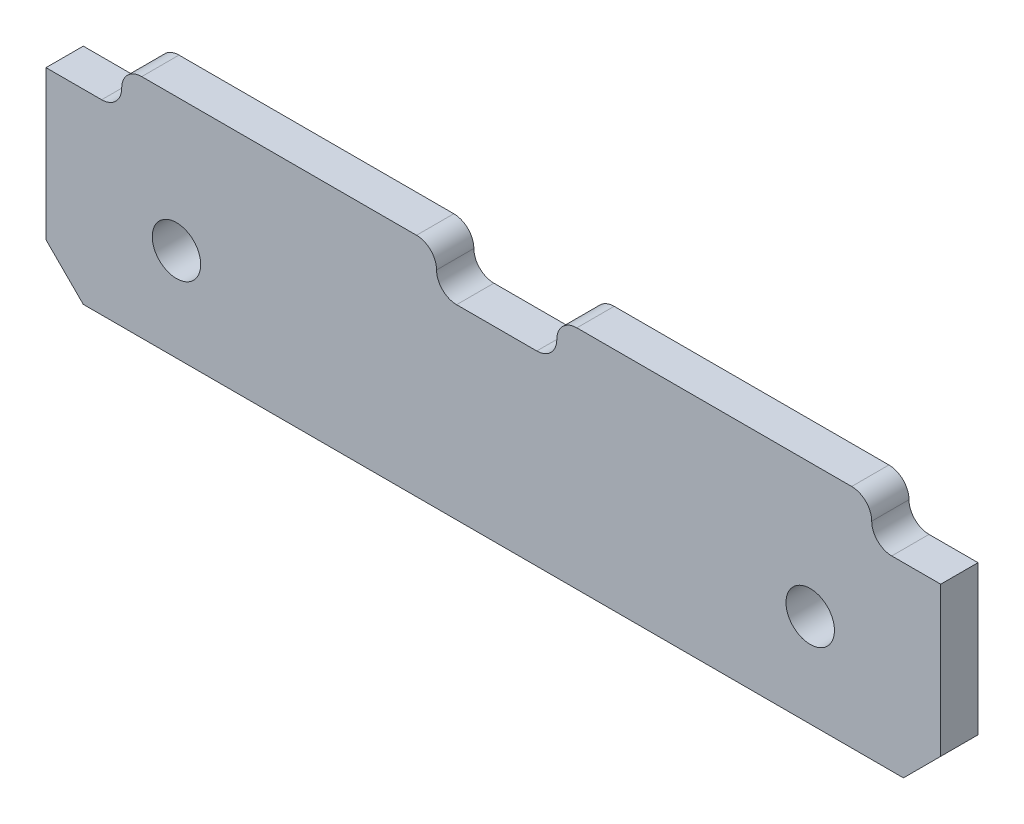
ISO-10303-21;
HEADER;
FILE_DESCRIPTION(('STEP AP214'),'2;1');
FILE_NAME('part.step','',(''),(''),'','','');
FILE_SCHEMA(('AUTOMOTIVE_DESIGN { 1 0 10303 214 1 1 1 1 }'));
ENDSEC;
DATA;
#1=APPLICATION_CONTEXT('core data for automotive mechanical design processes');
#2=APPLICATION_PROTOCOL_DEFINITION('international standard','automotive_design',2000,#1);
#3=PRODUCT_CONTEXT('',#1,'mechanical');
#4=PRODUCT('Part','Part','',(#3));
#5=PRODUCT_RELATED_PRODUCT_CATEGORY('part','',(#4));
#6=PRODUCT_DEFINITION_FORMATION('','',#4);
#7=PRODUCT_DEFINITION_CONTEXT('part definition',#1,'design');
#8=PRODUCT_DEFINITION('design','',#6,#7);
#9=PRODUCT_DEFINITION_SHAPE('','',#8);
#10=(LENGTH_UNIT() NAMED_UNIT(*) SI_UNIT(.MILLI.,.METRE.));
#11=(NAMED_UNIT(*) PLANE_ANGLE_UNIT() SI_UNIT($,.RADIAN.));
#12=(NAMED_UNIT(*) SI_UNIT($,.STERADIAN.) SOLID_ANGLE_UNIT());
#13=UNCERTAINTY_MEASURE_WITH_UNIT(LENGTH_MEASURE(1.E-05),#10,'distance_accuracy_value','');
#14=(GEOMETRIC_REPRESENTATION_CONTEXT(3) GLOBAL_UNCERTAINTY_ASSIGNED_CONTEXT((#13)) GLOBAL_UNIT_ASSIGNED_CONTEXT((#10,
#11,#12)) REPRESENTATION_CONTEXT('',''));
#15=CARTESIAN_POINT('',(0.,0.,0.));
#16=DIRECTION('',(0.,0.,1.));
#17=DIRECTION('',(1.,0.,0.));
#18=AXIS2_PLACEMENT_3D('',#15,#16,#17);
#19=CARTESIAN_POINT('',(0.,0.,10.));
#20=DIRECTION('',(0.,-1.,0.));
#21=DIRECTION('',(0.,0.,-1.));
#22=AXIS2_PLACEMENT_3D('',#19,#20,#21);
#23=PLANE('',#22);
#24=DIRECTION('',(0.,0.,-1.));
#25=VECTOR('',#24,1.);
#26=CARTESIAN_POINT('',(14.9254349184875,0.,10.));
#27=LINE('',#26,#25);
#28=CARTESIAN_POINT('',(14.9254349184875,0.,10.));
#29=VERTEX_POINT('',#28);
#30=CARTESIAN_POINT('',(14.9254349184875,0.,0.));
#31=VERTEX_POINT('',#30);
#32=EDGE_CURVE('E172',#29,#31,#27,.T.);
#33=ORIENTED_EDGE('',*,*,#32,.T.);
#34=DIRECTION('',(-1.,0.,0.));
#35=VECTOR('',#34,1.);
#36=CARTESIAN_POINT('',(0.,0.,0.));
#37=LINE('',#36,#35);
#38=CARTESIAN_POINT('',(0.,0.,0.));
#39=VERTEX_POINT('',#38);
#40=EDGE_CURVE('E281',#31,#39,#37,.T.);
#41=ORIENTED_EDGE('',*,*,#40,.T.);
#42=DIRECTION('',(0.,0.,-1.));
#43=VECTOR('',#42,1.);
#44=CARTESIAN_POINT('',(0.,0.,10.));
#45=LINE('',#44,#43);
#46=CARTESIAN_POINT('',(0.,0.,10.));
#47=VERTEX_POINT('',#46);
#48=EDGE_CURVE('E273',#47,#39,#45,.T.);
#49=ORIENTED_EDGE('',*,*,#48,.F.);
#50=DIRECTION('',(-1.,0.,0.));
#51=VECTOR('',#50,1.);
#52=CARTESIAN_POINT('',(0.,0.,10.));
#53=LINE('',#52,#51);
#54=EDGE_CURVE('E269',#29,#47,#53,.T.);
#55=ORIENTED_EDGE('',*,*,#54,.F.);
#56=EDGE_LOOP('',(#33,#41,#49,#55));
#57=FACE_BOUND('',#56,.T.);
#58=ADVANCED_FACE('F33',(#57),#23,.F.);
#59=CARTESIAN_POINT('',(131.646889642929,0.,0.));
#60=VERTEX_POINT('',#59);
#61=CARTESIAN_POINT('',(110.141513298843,0.,0.));
#62=VERTEX_POINT('',#61);
#63=EDGE_CURVE('E283',#60,#62,#37,.T.);
#64=ORIENTED_EDGE('',*,*,#63,.T.);
#65=DIRECTION('',(0.,0.,-1.));
#66=VECTOR('',#65,1.);
#67=CARTESIAN_POINT('',(110.141513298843,0.,10.));
#68=LINE('',#67,#66);
#69=CARTESIAN_POINT('',(110.141513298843,0.,10.));
#70=VERTEX_POINT('',#69);
#71=EDGE_CURVE('E196',#70,#62,#68,.T.);
#72=ORIENTED_EDGE('',*,*,#71,.F.);
#73=CARTESIAN_POINT('',(131.646889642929,0.,10.));
#74=VERTEX_POINT('',#73);
#75=EDGE_CURVE('E274',#74,#70,#53,.T.);
#76=ORIENTED_EDGE('',*,*,#75,.F.);
#77=DIRECTION('',(0.,0.,-1.));
#78=VECTOR('',#77,1.);
#79=CARTESIAN_POINT('',(131.646889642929,0.,10.));
#80=LINE('',#79,#78);
#81=EDGE_CURVE('E251',#74,#60,#80,.T.);
#82=ORIENTED_EDGE('',*,*,#81,.T.);
#83=EDGE_LOOP('',(#64,#72,#76,#82));
#84=FACE_BOUND('',#83,.T.);
#85=ADVANCED_FACE('F315',(#84),#23,.F.);
#86=CARTESIAN_POINT('',(0.,0.,10.));
#87=DIRECTION('',(1.,0.,0.));
#88=DIRECTION('',(0.,1.,0.));
#89=AXIS2_PLACEMENT_3D('',#86,#87,#88);
#90=PLANE('',#89);
#91=DIRECTION('',(0.,-1.,0.));
#92=VECTOR('',#91,1.);
#93=CARTESIAN_POINT('',(0.,0.,0.));
#94=LINE('',#93,#92);
#95=CARTESIAN_POINT('',(0.,-39.9999999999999,0.));
#96=VERTEX_POINT('',#95);
#97=EDGE_CURVE('E250',#39,#96,#94,.T.);
#98=ORIENTED_EDGE('',*,*,#97,.T.);
#99=DIRECTION('',(0.,0.,1.));
#100=VECTOR('',#99,1.);
#101=CARTESIAN_POINT('',(0.,-39.9999999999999,10.));
#102=LINE('',#101,#100);
#103=CARTESIAN_POINT('',(0.,-39.9999999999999,10.));
#104=VERTEX_POINT('',#103);
#105=EDGE_CURVE('E56',#96,#104,#102,.T.);
#106=ORIENTED_EDGE('',*,*,#105,.T.);
#107=DIRECTION('',(0.,-1.,0.));
#108=VECTOR('',#107,1.);
#109=CARTESIAN_POINT('',(0.,0.,10.));
#110=LINE('',#109,#108);
#111=EDGE_CURVE('E262',#47,#104,#110,.T.);
#112=ORIENTED_EDGE('',*,*,#111,.F.);
#113=ORIENTED_EDGE('',*,*,#48,.T.);
#114=EDGE_LOOP('',(#98,#106,#112,#113));
#115=FACE_BOUND('',#114,.T.);
#116=ADVANCED_FACE('F311',(#115),#90,.F.);
#117=CARTESIAN_POINT('',(0.,-50.,10.));
#118=DIRECTION('',(0.,1.,0.));
#119=DIRECTION('',(0.,0.,1.));
#120=AXIS2_PLACEMENT_3D('',#117,#118,#119);
#121=PLANE('',#120);
#122=DIRECTION('',(1.,0.,0.));
#123=VECTOR('',#122,1.);
#124=CARTESIAN_POINT('',(0.,-50.,10.));
#125=LINE('',#124,#123);
#126=CARTESIAN_POINT('',(10.,-50.,10.));
#127=VERTEX_POINT('',#126);
#128=CARTESIAN_POINT('',(230.,-50.,10.));
#129=VERTEX_POINT('',#128);
#130=EDGE_CURVE('E264',#127,#129,#125,.T.);
#131=ORIENTED_EDGE('',*,*,#130,.F.);
#132=DIRECTION('',(0.,0.,-1.));
#133=VECTOR('',#132,1.);
#134=CARTESIAN_POINT('',(10.,-50.,10.));
#135=LINE('',#134,#133);
#136=CARTESIAN_POINT('',(10.,-50.,0.));
#137=VERTEX_POINT('',#136);
#138=EDGE_CURVE('E291',#127,#137,#135,.T.);
#139=ORIENTED_EDGE('',*,*,#138,.T.);
#140=DIRECTION('',(1.,0.,0.));
#141=VECTOR('',#140,1.);
#142=CARTESIAN_POINT('',(0.,-50.,0.));
#143=LINE('',#142,#141);
#144=CARTESIAN_POINT('',(230.,-50.,0.));
#145=VERTEX_POINT('',#144);
#146=EDGE_CURVE('E276',#137,#145,#143,.T.);
#147=ORIENTED_EDGE('',*,*,#146,.T.);
#148=DIRECTION('',(0.,0.,1.));
#149=VECTOR('',#148,1.);
#150=CARTESIAN_POINT('',(230.,-50.,10.));
#151=LINE('',#150,#149);
#152=EDGE_CURVE('E289',#145,#129,#151,.T.);
#153=ORIENTED_EDGE('',*,*,#152,.T.);
#154=EDGE_LOOP('',(#131,#139,#147,#153));
#155=FACE_BOUND('',#154,.T.);
#156=ADVANCED_FACE('F304',(#155),#121,.F.);
#157=CARTESIAN_POINT('',(240.,0.,10.));
#158=DIRECTION('',(-1.,0.,0.));
#159=DIRECTION('',(0.,0.,1.));
#160=AXIS2_PLACEMENT_3D('',#157,#158,#159);
#161=PLANE('',#160);
#162=DIRECTION('',(0.,1.,0.));
#163=VECTOR('',#162,1.);
#164=CARTESIAN_POINT('',(240.,0.,10.));
#165=LINE('',#164,#163);
#166=CARTESIAN_POINT('',(240.,-40.,10.));
#167=VERTEX_POINT('',#166);
#168=CARTESIAN_POINT('',(240.,0.,10.));
#169=VERTEX_POINT('',#168);
#170=EDGE_CURVE('E267',#167,#169,#165,.T.);
#171=ORIENTED_EDGE('',*,*,#170,.F.);
#172=DIRECTION('',(0.,0.,-1.));
#173=VECTOR('',#172,1.);
#174=CARTESIAN_POINT('',(240.,-40.,10.));
#175=LINE('',#174,#173);
#176=CARTESIAN_POINT('',(240.,-40.,0.));
#177=VERTEX_POINT('',#176);
#178=EDGE_CURVE('E11',#167,#177,#175,.T.);
#179=ORIENTED_EDGE('',*,*,#178,.T.);
#180=DIRECTION('',(0.,1.,0.));
#181=VECTOR('',#180,1.);
#182=CARTESIAN_POINT('',(240.,0.,0.));
#183=LINE('',#182,#181);
#184=CARTESIAN_POINT('',(240.,0.,0.));
#185=VERTEX_POINT('',#184);
#186=EDGE_CURVE('E279',#177,#185,#183,.T.);
#187=ORIENTED_EDGE('',*,*,#186,.T.);
#188=DIRECTION('',(0.,0.,-1.));
#189=VECTOR('',#188,1.);
#190=CARTESIAN_POINT('',(240.,0.,10.));
#191=LINE('',#190,#189);
#192=EDGE_CURVE('E286',#169,#185,#191,.T.);
#193=ORIENTED_EDGE('',*,*,#192,.F.);
#194=EDGE_LOOP('',(#171,#179,#187,#193));
#195=FACE_BOUND('',#194,.T.);
#196=ADVANCED_FACE('F354',(#195),#161,.F.);
#197=CARTESIAN_POINT('',(226.862968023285,0.,0.));
#198=VERTEX_POINT('',#197);
#199=EDGE_CURVE('E265',#185,#198,#37,.T.);
#200=ORIENTED_EDGE('',*,*,#199,.T.);
#201=DIRECTION('',(0.,0.,-1.));
#202=VECTOR('',#201,1.);
#203=CARTESIAN_POINT('',(226.862968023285,0.,10.));
#204=LINE('',#203,#202);
#205=CARTESIAN_POINT('',(226.862968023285,0.,10.));
#206=VERTEX_POINT('',#205);
#207=EDGE_CURVE('E254',#206,#198,#204,.T.);
#208=ORIENTED_EDGE('',*,*,#207,.F.);
#209=EDGE_CURVE('E270',#169,#206,#53,.T.);
#210=ORIENTED_EDGE('',*,*,#209,.F.);
#211=ORIENTED_EDGE('',*,*,#192,.T.);
#212=EDGE_LOOP('',(#200,#208,#210,#211));
#213=FACE_BOUND('',#212,.T.);
#214=ADVANCED_FACE('F350',(#213),#23,.F.);
#215=CARTESIAN_POINT('',(0.,0.,10.));
#216=DIRECTION('',(0.,0.,1.));
#217=DIRECTION('',(1.,0.,0.));
#218=AXIS2_PLACEMENT_3D('',#215,#216,#217);
#219=PLANE('',#218);
#220=CARTESIAN_POINT('',(35.,-25.,10.));
#221=DIRECTION('',(0.,0.,-1.));
#222=DIRECTION('',(-1.,0.,0.));
#223=AXIS2_PLACEMENT_3D('',#220,#221,#222);
#224=CIRCLE('',#223,6.5);
#225=CARTESIAN_POINT('',(28.5,-25.,10.));
#226=VERTEX_POINT('',#225);
#227=EDGE_CURVE('E549',#226,#226,#224,.T.);
#228=ORIENTED_EDGE('',*,*,#227,.T.);
#229=EDGE_LOOP('',(#228));
#230=FACE_BOUND('',#229,.T.);
#231=CARTESIAN_POINT('',(205.,-25.,10.));
#232=DIRECTION('',(0.,0.,-1.));
#233=DIRECTION('',(-1.,0.,0.));
#234=AXIS2_PLACEMENT_3D('',#231,#232,#233);
#235=CIRCLE('',#234,6.50000000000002);
#236=CARTESIAN_POINT('',(198.5,-25.,10.));
#237=VERTEX_POINT('',#236);
#238=EDGE_CURVE('E201',#237,#237,#235,.T.);
#239=ORIENTED_EDGE('',*,*,#238,.T.);
#240=EDGE_LOOP('',(#239));
#241=FACE_BOUND('',#240,.T.);
#242=ORIENTED_EDGE('',*,*,#111,.T.);
#243=DIRECTION('',(-0.707106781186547,0.707106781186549,0.));
#244=VECTOR('',#243,1.);
#245=CARTESIAN_POINT('',(-20.,-19.9999999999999,10.));
#246=LINE('',#245,#244);
#247=EDGE_CURVE('E41',#104,#127,#246,.F.);
#248=ORIENTED_EDGE('',*,*,#247,.T.);
#249=ORIENTED_EDGE('',*,*,#130,.T.);
#250=DIRECTION('',(-0.707106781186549,-0.707106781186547,0.));
#251=VECTOR('',#250,1.);
#252=CARTESIAN_POINT('',(140.,-140.,10.));
#253=LINE('',#252,#251);
#254=EDGE_CURVE('E48',#129,#167,#253,.F.);
#255=ORIENTED_EDGE('',*,*,#254,.T.);
#256=ORIENTED_EDGE('',*,*,#170,.T.);
#257=ORIENTED_EDGE('',*,*,#209,.T.);
#258=CARTESIAN_POINT('',(226.862968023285,5.37634408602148,10.));
#259=DIRECTION('',(0.,0.,1.));
#260=DIRECTION('',(-1.,0.,0.));
#261=AXIS2_PLACEMENT_3D('',#258,#259,#260);
#262=CIRCLE('',#261,5.37634408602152);
#263=CARTESIAN_POINT('',(221.486623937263,5.37634408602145,10.));
#264=VERTEX_POINT('',#263);
#265=EDGE_CURVE('E228',#264,#206,#262,.T.);
#266=ORIENTED_EDGE('',*,*,#265,.F.);
#267=CARTESIAN_POINT('',(216.110279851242,5.37634408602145,10.));
#268=DIRECTION('',(0.,0.,-1.));
#269=DIRECTION('',(-1.,0.,0.));
#270=AXIS2_PLACEMENT_3D('',#267,#268,#269);
#271=CIRCLE('',#270,5.37634408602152);
#272=CARTESIAN_POINT('',(216.110279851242,10.752688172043,10.));
#273=VERTEX_POINT('',#272);
#274=EDGE_CURVE('E225',#273,#264,#271,.T.);
#275=ORIENTED_EDGE('',*,*,#274,.F.);
#276=DIRECTION('',(1.,0.,0.));
#277=VECTOR('',#276,1.);
#278=CARTESIAN_POINT('',(216.110279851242,10.752688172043,10.));
#279=LINE('',#278,#277);
#280=CARTESIAN_POINT('',(142.399577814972,10.752688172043,10.));
#281=VERTEX_POINT('',#280);
#282=EDGE_CURVE('E221',#281,#273,#279,.T.);
#283=ORIENTED_EDGE('',*,*,#282,.F.);
#284=CARTESIAN_POINT('',(142.399577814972,5.37634408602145,10.));
#285=DIRECTION('',(0.,0.,-1.));
#286=DIRECTION('',(-1.,0.,0.));
#287=AXIS2_PLACEMENT_3D('',#284,#285,#286);
#288=CIRCLE('',#287,5.3763440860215);
#289=CARTESIAN_POINT('',(137.023233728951,5.37634408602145,10.));
#290=VERTEX_POINT('',#289);
#291=EDGE_CURVE('E218',#290,#281,#288,.T.);
#292=ORIENTED_EDGE('',*,*,#291,.F.);
#293=CARTESIAN_POINT('',(131.646889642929,5.37634408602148,10.));
#294=DIRECTION('',(0.,0.,1.));
#295=DIRECTION('',(-1.,0.,0.));
#296=AXIS2_PLACEMENT_3D('',#293,#294,#295);
#297=CIRCLE('',#296,5.3763440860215);
#298=EDGE_CURVE('E231',#74,#290,#297,.T.);
#299=ORIENTED_EDGE('',*,*,#298,.F.);
#300=ORIENTED_EDGE('',*,*,#75,.T.);
#301=CARTESIAN_POINT('',(110.141513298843,5.37634408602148,10.));
#302=DIRECTION('',(0.,0.,1.));
#303=DIRECTION('',(-1.,0.,0.));
#304=AXIS2_PLACEMENT_3D('',#301,#302,#303);
#305=CIRCLE('',#304,5.3763440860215);
#306=CARTESIAN_POINT('',(104.765169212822,5.37634408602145,10.));
#307=VERTEX_POINT('',#306);
#308=EDGE_CURVE('E185',#307,#70,#305,.T.);
#309=ORIENTED_EDGE('',*,*,#308,.F.);
#310=CARTESIAN_POINT('',(99.3888251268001,5.37634408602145,10.));
#311=DIRECTION('',(0.,0.,-1.));
#312=DIRECTION('',(-1.,0.,0.));
#313=AXIS2_PLACEMENT_3D('',#310,#311,#312);
#314=CIRCLE('',#313,5.37634408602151);
#315=CARTESIAN_POINT('',(99.3888251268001,10.752688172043,10.));
#316=VERTEX_POINT('',#315);
#317=EDGE_CURVE('E193',#316,#307,#314,.T.);
#318=ORIENTED_EDGE('',*,*,#317,.F.);
#319=DIRECTION('',(1.,0.,0.));
#320=VECTOR('',#319,1.);
#321=CARTESIAN_POINT('',(99.3888251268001,10.752688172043,10.));
#322=LINE('',#321,#320);
#323=CARTESIAN_POINT('',(25.6781230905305,10.752688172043,10.));
#324=VERTEX_POINT('',#323);
#325=EDGE_CURVE('E180',#324,#316,#322,.T.);
#326=ORIENTED_EDGE('',*,*,#325,.F.);
#327=CARTESIAN_POINT('',(25.6781230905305,5.37634408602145,10.));
#328=DIRECTION('',(0.,0.,-1.));
#329=DIRECTION('',(-1.,0.,0.));
#330=AXIS2_PLACEMENT_3D('',#327,#328,#329);
#331=CIRCLE('',#330,5.37634408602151);
#332=CARTESIAN_POINT('',(20.301779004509,5.37634408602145,10.));
#333=VERTEX_POINT('',#332);
#334=EDGE_CURVE('E164',#333,#324,#331,.T.);
#335=ORIENTED_EDGE('',*,*,#334,.F.);
#336=CARTESIAN_POINT('',(14.9254349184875,5.37634408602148,10.));
#337=DIRECTION('',(0.,0.,1.));
#338=DIRECTION('',(-1.,0.,0.));
#339=AXIS2_PLACEMENT_3D('',#336,#337,#338);
#340=CIRCLE('',#339,5.37634408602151);
#341=EDGE_CURVE('E177',#29,#333,#340,.T.);
#342=ORIENTED_EDGE('',*,*,#341,.F.);
#343=ORIENTED_EDGE('',*,*,#54,.T.);
#344=EDGE_LOOP('',(#242,#248,#249,#255,#256,#257,#266,#275,#283,#292,#299,#300,#309,#318,#326,
#335,#342,#343));
#345=FACE_BOUND('',#344,.T.);
#346=ADVANCED_FACE('F176',(#230,#241,#345),#219,.T.);
#347=CARTESIAN_POINT('',(0.,0.,0.));
#348=DIRECTION('',(0.,0.,1.));
#349=DIRECTION('',(1.,0.,0.));
#350=AXIS2_PLACEMENT_3D('',#347,#348,#349);
#351=PLANE('',#350);
#352=CARTESIAN_POINT('',(35.,-25.,0.));
#353=DIRECTION('',(0.,0.,-1.));
#354=DIRECTION('',(-1.,0.,0.));
#355=AXIS2_PLACEMENT_3D('',#352,#353,#354);
#356=CIRCLE('',#355,6.5);
#357=CARTESIAN_POINT('',(28.5,-25.,0.));
#358=VERTEX_POINT('',#357);
#359=EDGE_CURVE('E552',#358,#358,#356,.T.);
#360=ORIENTED_EDGE('',*,*,#359,.F.);
#361=EDGE_LOOP('',(#360));
#362=FACE_BOUND('',#361,.T.);
#363=CARTESIAN_POINT('',(205.,-25.,0.));
#364=DIRECTION('',(0.,0.,-1.));
#365=DIRECTION('',(-1.,0.,0.));
#366=AXIS2_PLACEMENT_3D('',#363,#364,#365);
#367=CIRCLE('',#366,6.50000000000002);
#368=CARTESIAN_POINT('',(198.5,-25.,0.));
#369=VERTEX_POINT('',#368);
#370=EDGE_CURVE('E554',#369,#369,#367,.T.);
#371=ORIENTED_EDGE('',*,*,#370,.F.);
#372=EDGE_LOOP('',(#371));
#373=FACE_BOUND('',#372,.T.);
#374=ORIENTED_EDGE('',*,*,#146,.F.);
#375=DIRECTION('',(0.707106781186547,-0.707106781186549,0.));
#376=VECTOR('',#375,1.);
#377=CARTESIAN_POINT('',(10.,-50.,0.));
#378=LINE('',#377,#376);
#379=EDGE_CURVE('E296',#137,#96,#378,.F.);
#380=ORIENTED_EDGE('',*,*,#379,.T.);
#381=ORIENTED_EDGE('',*,*,#97,.F.);
#382=ORIENTED_EDGE('',*,*,#40,.F.);
#383=CARTESIAN_POINT('',(14.9254349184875,5.37634408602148,0.));
#384=DIRECTION('',(0.,0.,1.));
#385=DIRECTION('',(-1.,0.,0.));
#386=AXIS2_PLACEMENT_3D('',#383,#384,#385);
#387=CIRCLE('',#386,5.37634408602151);
#388=CARTESIAN_POINT('',(20.301779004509,5.37634408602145,0.));
#389=VERTEX_POINT('',#388);
#390=EDGE_CURVE('E200',#31,#389,#387,.T.);
#391=ORIENTED_EDGE('',*,*,#390,.T.);
#392=CARTESIAN_POINT('',(25.6781230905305,5.37634408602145,0.));
#393=DIRECTION('',(0.,0.,-1.));
#394=DIRECTION('',(-1.,0.,0.));
#395=AXIS2_PLACEMENT_3D('',#392,#393,#394);
#396=CIRCLE('',#395,5.37634408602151);
#397=CARTESIAN_POINT('',(25.6781230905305,10.752688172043,0.));
#398=VERTEX_POINT('',#397);
#399=EDGE_CURVE('E166',#389,#398,#396,.T.);
#400=ORIENTED_EDGE('',*,*,#399,.T.);
#401=DIRECTION('',(1.,0.,0.));
#402=VECTOR('',#401,1.);
#403=CARTESIAN_POINT('',(99.3888251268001,10.752688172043,0.));
#404=LINE('',#403,#402);
#405=CARTESIAN_POINT('',(99.3888251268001,10.752688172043,0.));
#406=VERTEX_POINT('',#405);
#407=EDGE_CURVE('E204',#398,#406,#404,.T.);
#408=ORIENTED_EDGE('',*,*,#407,.T.);
#409=CARTESIAN_POINT('',(99.3888251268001,5.37634408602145,0.));
#410=DIRECTION('',(0.,0.,-1.));
#411=DIRECTION('',(-1.,0.,0.));
#412=AXIS2_PLACEMENT_3D('',#409,#410,#411);
#413=CIRCLE('',#412,5.37634408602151);
#414=CARTESIAN_POINT('',(104.765169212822,5.37634408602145,0.));
#415=VERTEX_POINT('',#414);
#416=EDGE_CURVE('E188',#406,#415,#413,.T.);
#417=ORIENTED_EDGE('',*,*,#416,.T.);
#418=CARTESIAN_POINT('',(110.141513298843,5.37634408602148,0.));
#419=DIRECTION('',(0.,0.,1.));
#420=DIRECTION('',(-1.,0.,0.));
#421=AXIS2_PLACEMENT_3D('',#418,#419,#420);
#422=CIRCLE('',#421,5.3763440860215);
#423=EDGE_CURVE('E197',#415,#62,#422,.T.);
#424=ORIENTED_EDGE('',*,*,#423,.T.);
#425=ORIENTED_EDGE('',*,*,#63,.F.);
#426=CARTESIAN_POINT('',(131.646889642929,5.37634408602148,0.));
#427=DIRECTION('',(0.,0.,1.));
#428=DIRECTION('',(-1.,0.,0.));
#429=AXIS2_PLACEMENT_3D('',#426,#427,#428);
#430=CIRCLE('',#429,5.3763440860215);
#431=CARTESIAN_POINT('',(137.023233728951,5.37634408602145,0.));
#432=VERTEX_POINT('',#431);
#433=EDGE_CURVE('E222',#60,#432,#430,.T.);
#434=ORIENTED_EDGE('',*,*,#433,.T.);
#435=CARTESIAN_POINT('',(142.399577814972,5.37634408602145,0.));
#436=DIRECTION('',(0.,0.,-1.));
#437=DIRECTION('',(-1.,0.,0.));
#438=AXIS2_PLACEMENT_3D('',#435,#436,#437);
#439=CIRCLE('',#438,5.3763440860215);
#440=CARTESIAN_POINT('',(142.399577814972,10.752688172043,0.));
#441=VERTEX_POINT('',#440);
#442=EDGE_CURVE('E211',#432,#441,#439,.T.);
#443=ORIENTED_EDGE('',*,*,#442,.T.);
#444=DIRECTION('',(1.,0.,0.));
#445=VECTOR('',#444,1.);
#446=CARTESIAN_POINT('',(216.110279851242,10.752688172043,0.));
#447=LINE('',#446,#445);
#448=CARTESIAN_POINT('',(216.110279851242,10.752688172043,0.));
#449=VERTEX_POINT('',#448);
#450=EDGE_CURVE('E237',#441,#449,#447,.T.);
#451=ORIENTED_EDGE('',*,*,#450,.T.);
#452=CARTESIAN_POINT('',(216.110279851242,5.37634408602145,0.));
#453=DIRECTION('',(0.,0.,-1.));
#454=DIRECTION('',(-1.,0.,0.));
#455=AXIS2_PLACEMENT_3D('',#452,#453,#454);
#456=CIRCLE('',#455,5.37634408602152);
#457=CARTESIAN_POINT('',(221.486623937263,5.37634408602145,0.));
#458=VERTEX_POINT('',#457);
#459=EDGE_CURVE('E240',#449,#458,#456,.T.);
#460=ORIENTED_EDGE('',*,*,#459,.T.);
#461=CARTESIAN_POINT('',(226.862968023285,5.37634408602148,0.));
#462=DIRECTION('',(0.,0.,1.));
#463=DIRECTION('',(-1.,0.,0.));
#464=AXIS2_PLACEMENT_3D('',#461,#462,#463);
#465=CIRCLE('',#464,5.37634408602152);
#466=EDGE_CURVE('E243',#458,#198,#465,.T.);
#467=ORIENTED_EDGE('',*,*,#466,.T.);
#468=ORIENTED_EDGE('',*,*,#199,.F.);
#469=ORIENTED_EDGE('',*,*,#186,.F.);
#470=DIRECTION('',(0.707106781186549,0.707106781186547,0.));
#471=VECTOR('',#470,1.);
#472=CARTESIAN_POINT('',(240.,-40.,0.));
#473=LINE('',#472,#471);
#474=EDGE_CURVE('E294',#177,#145,#473,.F.);
#475=ORIENTED_EDGE('',*,*,#474,.T.);
#476=EDGE_LOOP('',(#374,#380,#381,#382,#391,#400,#408,#417,#424,#425,#434,#443,#451,#460,#467,
#468,#469,#475));
#477=FACE_BOUND('',#476,.T.);
#478=ADVANCED_FACE('F310',(#362,#373,#477),#351,.F.);
#479=CARTESIAN_POINT('',(142.399577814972,5.37634408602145,10.));
#480=DIRECTION('',(0.,0.,-1.));
#481=DIRECTION('',(-1.,0.,0.));
#482=AXIS2_PLACEMENT_3D('',#479,#480,#481);
#483=CYLINDRICAL_SURFACE('',#482,5.3763440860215);
#484=ORIENTED_EDGE('',*,*,#442,.F.);
#485=DIRECTION('',(0.,0.,-1.));
#486=VECTOR('',#485,1.);
#487=CARTESIAN_POINT('',(137.023233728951,5.37634408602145,10.));
#488=LINE('',#487,#486);
#489=EDGE_CURVE('E248',#290,#432,#488,.T.);
#490=ORIENTED_EDGE('',*,*,#489,.F.);
#491=ORIENTED_EDGE('',*,*,#291,.T.);
#492=DIRECTION('',(0.,0.,-1.));
#493=VECTOR('',#492,1.);
#494=CARTESIAN_POINT('',(142.399577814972,10.752688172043,10.));
#495=LINE('',#494,#493);
#496=EDGE_CURVE('E234',#281,#441,#495,.T.);
#497=ORIENTED_EDGE('',*,*,#496,.T.);
#498=EDGE_LOOP('',(#484,#490,#491,#497));
#499=FACE_BOUND('',#498,.T.);
#500=ADVANCED_FACE('F334',(#499),#483,.T.);
#501=CARTESIAN_POINT('',(131.646889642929,5.37634408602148,10.));
#502=DIRECTION('',(0.,0.,-1.));
#503=DIRECTION('',(-1.,0.,0.));
#504=AXIS2_PLACEMENT_3D('',#501,#502,#503);
#505=CYLINDRICAL_SURFACE('',#504,5.3763440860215);
#506=ORIENTED_EDGE('',*,*,#433,.F.);
#507=ORIENTED_EDGE('',*,*,#81,.F.);
#508=ORIENTED_EDGE('',*,*,#298,.T.);
#509=ORIENTED_EDGE('',*,*,#489,.T.);
#510=EDGE_LOOP('',(#506,#507,#508,#509));
#511=FACE_BOUND('',#510,.T.);
#512=ADVANCED_FACE('F330',(#511),#505,.F.);
#513=CARTESIAN_POINT('',(226.862968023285,5.37634408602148,10.));
#514=DIRECTION('',(0.,0.,-1.));
#515=DIRECTION('',(-1.,0.,0.));
#516=AXIS2_PLACEMENT_3D('',#513,#514,#515);
#517=CYLINDRICAL_SURFACE('',#516,5.37634408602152);
#518=ORIENTED_EDGE('',*,*,#466,.F.);
#519=DIRECTION('',(0.,0.,-1.));
#520=VECTOR('',#519,1.);
#521=CARTESIAN_POINT('',(221.486623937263,5.37634408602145,10.));
#522=LINE('',#521,#520);
#523=EDGE_CURVE('E257',#264,#458,#522,.T.);
#524=ORIENTED_EDGE('',*,*,#523,.F.);
#525=ORIENTED_EDGE('',*,*,#265,.T.);
#526=ORIENTED_EDGE('',*,*,#207,.T.);
#527=EDGE_LOOP('',(#518,#524,#525,#526));
#528=FACE_BOUND('',#527,.T.);
#529=ADVANCED_FACE('F346',(#528),#517,.F.);
#530=CARTESIAN_POINT('',(216.110279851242,5.37634408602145,10.));
#531=DIRECTION('',(0.,0.,-1.));
#532=DIRECTION('',(-1.,0.,0.));
#533=AXIS2_PLACEMENT_3D('',#530,#531,#532);
#534=CYLINDRICAL_SURFACE('',#533,5.37634408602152);
#535=ORIENTED_EDGE('',*,*,#459,.F.);
#536=DIRECTION('',(0.,0.,-1.));
#537=VECTOR('',#536,1.);
#538=CARTESIAN_POINT('',(216.110279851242,10.752688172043,10.));
#539=LINE('',#538,#537);
#540=EDGE_CURVE('E259',#273,#449,#539,.T.);
#541=ORIENTED_EDGE('',*,*,#540,.F.);
#542=ORIENTED_EDGE('',*,*,#274,.T.);
#543=ORIENTED_EDGE('',*,*,#523,.T.);
#544=EDGE_LOOP('',(#535,#541,#542,#543));
#545=FACE_BOUND('',#544,.T.);
#546=ADVANCED_FACE('F341',(#545),#534,.T.);
#547=CARTESIAN_POINT('',(216.110279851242,10.752688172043,10.));
#548=DIRECTION('',(0.,1.,0.));
#549=DIRECTION('',(0.,0.,1.));
#550=AXIS2_PLACEMENT_3D('',#547,#548,#549);
#551=PLANE('',#550);
#552=ORIENTED_EDGE('',*,*,#450,.F.);
#553=ORIENTED_EDGE('',*,*,#496,.F.);
#554=ORIENTED_EDGE('',*,*,#282,.T.);
#555=ORIENTED_EDGE('',*,*,#540,.T.);
#556=EDGE_LOOP('',(#552,#553,#554,#555));
#557=FACE_BOUND('',#556,.T.);
#558=ADVANCED_FACE('F337',(#557),#551,.T.);
#559=CARTESIAN_POINT('',(110.141513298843,5.37634408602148,10.));
#560=DIRECTION('',(0.,0.,-1.));
#561=DIRECTION('',(-1.,0.,0.));
#562=AXIS2_PLACEMENT_3D('',#559,#560,#561);
#563=CYLINDRICAL_SURFACE('',#562,5.3763440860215);
#564=ORIENTED_EDGE('',*,*,#423,.F.);
#565=DIRECTION('',(0.,0.,-1.));
#566=VECTOR('',#565,1.);
#567=CARTESIAN_POINT('',(104.765169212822,5.37634408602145,10.));
#568=LINE('',#567,#566);
#569=EDGE_CURVE('E209',#307,#415,#568,.T.);
#570=ORIENTED_EDGE('',*,*,#569,.F.);
#571=ORIENTED_EDGE('',*,*,#308,.T.);
#572=ORIENTED_EDGE('',*,*,#71,.T.);
#573=EDGE_LOOP('',(#564,#570,#571,#572));
#574=FACE_BOUND('',#573,.T.);
#575=ADVANCED_FACE('F321',(#574),#563,.F.);
#576=CARTESIAN_POINT('',(99.3888251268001,5.37634408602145,10.));
#577=DIRECTION('',(0.,0.,-1.));
#578=DIRECTION('',(-1.,0.,0.));
#579=AXIS2_PLACEMENT_3D('',#576,#577,#578);
#580=CYLINDRICAL_SURFACE('',#579,5.37634408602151);
#581=ORIENTED_EDGE('',*,*,#416,.F.);
#582=DIRECTION('',(0.,0.,-1.));
#583=VECTOR('',#582,1.);
#584=CARTESIAN_POINT('',(99.3888251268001,10.752688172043,10.));
#585=LINE('',#584,#583);
#586=EDGE_CURVE('E212',#316,#406,#585,.T.);
#587=ORIENTED_EDGE('',*,*,#586,.F.);
#588=ORIENTED_EDGE('',*,*,#317,.T.);
#589=ORIENTED_EDGE('',*,*,#569,.T.);
#590=EDGE_LOOP('',(#581,#587,#588,#589));
#591=FACE_BOUND('',#590,.T.);
#592=ADVANCED_FACE('F326',(#591),#580,.T.);
#593=CARTESIAN_POINT('',(99.3888251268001,10.752688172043,10.));
#594=DIRECTION('',(0.,1.,0.));
#595=DIRECTION('',(0.,0.,1.));
#596=AXIS2_PLACEMENT_3D('',#593,#594,#595);
#597=PLANE('',#596);
#598=ORIENTED_EDGE('',*,*,#407,.F.);
#599=DIRECTION('',(0.,0.,-1.));
#600=VECTOR('',#599,1.);
#601=CARTESIAN_POINT('',(25.6781230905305,10.752688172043,10.));
#602=LINE('',#601,#600);
#603=EDGE_CURVE('E171',#324,#398,#602,.T.);
#604=ORIENTED_EDGE('',*,*,#603,.F.);
#605=ORIENTED_EDGE('',*,*,#325,.T.);
#606=ORIENTED_EDGE('',*,*,#586,.T.);
#607=EDGE_LOOP('',(#598,#604,#605,#606));
#608=FACE_BOUND('',#607,.T.);
#609=ADVANCED_FACE('F481',(#608),#597,.T.);
#610=CARTESIAN_POINT('',(25.6781230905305,5.37634408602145,10.));
#611=DIRECTION('',(0.,0.,-1.));
#612=DIRECTION('',(-1.,0.,0.));
#613=AXIS2_PLACEMENT_3D('',#610,#611,#612);
#614=CYLINDRICAL_SURFACE('',#613,5.37634408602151);
#615=ORIENTED_EDGE('',*,*,#399,.F.);
#616=DIRECTION('',(0.,0.,-1.));
#617=VECTOR('',#616,1.);
#618=CARTESIAN_POINT('',(20.301779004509,5.37634408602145,10.));
#619=LINE('',#618,#617);
#620=EDGE_CURVE('E161',#333,#389,#619,.T.);
#621=ORIENTED_EDGE('',*,*,#620,.F.);
#622=ORIENTED_EDGE('',*,*,#334,.T.);
#623=ORIENTED_EDGE('',*,*,#603,.T.);
#624=EDGE_LOOP('',(#615,#621,#622,#623));
#625=FACE_BOUND('',#624,.T.);
#626=ADVANCED_FACE('F163',(#625),#614,.T.);
#627=CARTESIAN_POINT('',(14.9254349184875,5.37634408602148,10.));
#628=DIRECTION('',(0.,0.,-1.));
#629=DIRECTION('',(-1.,0.,0.));
#630=AXIS2_PLACEMENT_3D('',#627,#628,#629);
#631=CYLINDRICAL_SURFACE('',#630,5.37634408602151);
#632=ORIENTED_EDGE('',*,*,#390,.F.);
#633=ORIENTED_EDGE('',*,*,#32,.F.);
#634=ORIENTED_EDGE('',*,*,#341,.T.);
#635=ORIENTED_EDGE('',*,*,#620,.T.);
#636=EDGE_LOOP('',(#632,#633,#634,#635));
#637=FACE_BOUND('',#636,.T.);
#638=ADVANCED_FACE('F183',(#637),#631,.F.);
#639=CARTESIAN_POINT('',(205.,-25.,10.));
#640=DIRECTION('',(0.,0.,-1.));
#641=DIRECTION('',(-1.,0.,0.));
#642=AXIS2_PLACEMENT_3D('',#639,#640,#641);
#643=CYLINDRICAL_SURFACE('',#642,6.50000000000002);
#644=ORIENTED_EDGE('',*,*,#238,.F.);
#645=EDGE_LOOP('',(#644));
#646=FACE_BOUND('',#645,.T.);
#647=ORIENTED_EDGE('',*,*,#370,.T.);
#648=EDGE_LOOP('',(#647));
#649=FACE_BOUND('',#648,.T.);
#650=ADVANCED_FACE('F501',(#646,#649),#643,.F.);
#651=CARTESIAN_POINT('',(35.,-25.,10.));
#652=DIRECTION('',(0.,0.,-1.));
#653=DIRECTION('',(-1.,0.,0.));
#654=AXIS2_PLACEMENT_3D('',#651,#652,#653);
#655=CYLINDRICAL_SURFACE('',#654,6.5);
#656=ORIENTED_EDGE('',*,*,#227,.F.);
#657=EDGE_LOOP('',(#656));
#658=FACE_BOUND('',#657,.T.);
#659=ORIENTED_EDGE('',*,*,#359,.T.);
#660=EDGE_LOOP('',(#659));
#661=FACE_BOUND('',#660,.T.);
#662=ADVANCED_FACE('F360',(#658,#661),#655,.F.);
#663=CARTESIAN_POINT('',(10.,-50.,10.));
#664=DIRECTION('',(0.707106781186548,0.707106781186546,0.));
#665=DIRECTION('',(0.,0.,-1.));
#666=AXIS2_PLACEMENT_3D('',#663,#664,#665);
#667=PLANE('',#666);
#668=ORIENTED_EDGE('',*,*,#247,.F.);
#669=ORIENTED_EDGE('',*,*,#105,.F.);
#670=ORIENTED_EDGE('',*,*,#379,.F.);
#671=ORIENTED_EDGE('',*,*,#138,.F.);
#672=EDGE_LOOP('',(#668,#669,#670,#671));
#673=FACE_BOUND('',#672,.T.);
#674=ADVANCED_FACE('F307',(#673),#667,.F.);
#675=CARTESIAN_POINT('',(240.,-40.,10.));
#676=DIRECTION('',(-0.707106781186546,0.707106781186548,0.));
#677=DIRECTION('',(0.,0.,-1.));
#678=AXIS2_PLACEMENT_3D('',#675,#676,#677);
#679=PLANE('',#678);
#680=ORIENTED_EDGE('',*,*,#254,.F.);
#681=ORIENTED_EDGE('',*,*,#152,.F.);
#682=ORIENTED_EDGE('',*,*,#474,.F.);
#683=ORIENTED_EDGE('',*,*,#178,.F.);
#684=EDGE_LOOP('',(#680,#681,#682,#683));
#685=FACE_BOUND('',#684,.T.);
#686=ADVANCED_FACE('F35',(#685),#679,.F.);
#687=CLOSED_SHELL('',(#58,#85,#116,#156,#196,#214,#346,#478,#500,#512,#529,#546,#558,#575,#592,
#609,#626,#638,#650,#662,#674,#686));
#688=MANIFOLD_SOLID_BREP('B2',#687);
#689=ADVANCED_BREP_SHAPE_REPRESENTATION('',(#18,#688),#14);
#690=SHAPE_DEFINITION_REPRESENTATION(#9,#689);
ENDSEC;
END-ISO-10303-21;
